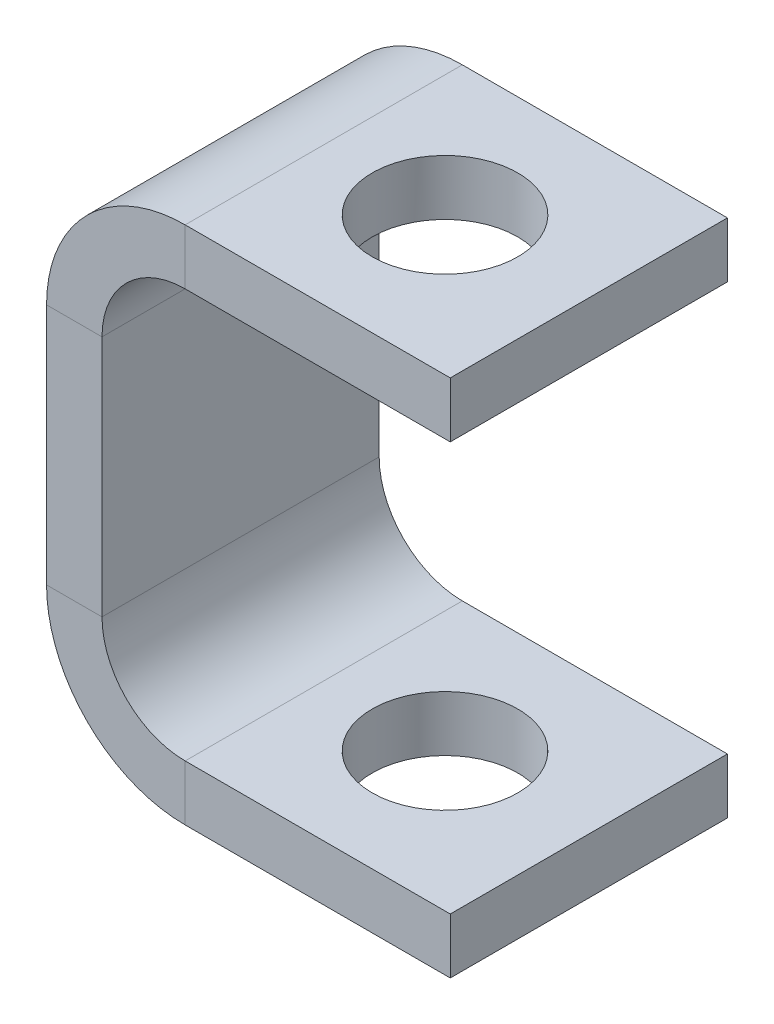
ISO-10303-21;
HEADER;
FILE_DESCRIPTION(('STEP AP214'),'2;1');
FILE_NAME('part.step','',(''),(''),'','','');
FILE_SCHEMA(('AUTOMOTIVE_DESIGN { 1 0 10303 214 1 1 1 1 }'));
ENDSEC;
DATA;
#1=APPLICATION_CONTEXT('core data for automotive mechanical design processes');
#2=APPLICATION_PROTOCOL_DEFINITION('international standard','automotive_design',2000,#1);
#3=PRODUCT_CONTEXT('',#1,'mechanical');
#4=PRODUCT('Part','Part','',(#3));
#5=PRODUCT_RELATED_PRODUCT_CATEGORY('part','',(#4));
#6=PRODUCT_DEFINITION_FORMATION('','',#4);
#7=PRODUCT_DEFINITION_CONTEXT('part definition',#1,'design');
#8=PRODUCT_DEFINITION('design','',#6,#7);
#9=PRODUCT_DEFINITION_SHAPE('','',#8);
#10=(LENGTH_UNIT() NAMED_UNIT(*) SI_UNIT(.MILLI.,.METRE.));
#11=(NAMED_UNIT(*) PLANE_ANGLE_UNIT() SI_UNIT($,.RADIAN.));
#12=(NAMED_UNIT(*) SI_UNIT($,.STERADIAN.) SOLID_ANGLE_UNIT());
#13=UNCERTAINTY_MEASURE_WITH_UNIT(LENGTH_MEASURE(1.E-05),#10,'distance_accuracy_value','');
#14=(GEOMETRIC_REPRESENTATION_CONTEXT(3) GLOBAL_UNCERTAINTY_ASSIGNED_CONTEXT((#13)) GLOBAL_UNIT_ASSIGNED_CONTEXT((#10,
#11,#12)) REPRESENTATION_CONTEXT('',''));
#15=CARTESIAN_POINT('',(0.,0.,0.));
#16=DIRECTION('',(0.,0.,1.));
#17=DIRECTION('',(1.,0.,0.));
#18=AXIS2_PLACEMENT_3D('',#15,#16,#17);
#19=CARTESIAN_POINT('',(-409.941170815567,-35.,-40.));
#20=DIRECTION('',(0.,0.,-1.));
#21=DIRECTION('',(-1.,0.,0.));
#22=AXIS2_PLACEMENT_3D('',#19,#20,#21);
#23=PLANE('',#22);
#24=DIRECTION('',(1.,0.,0.));
#25=VECTOR('',#24,1.);
#26=CARTESIAN_POINT('',(-425.941170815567,-59.,-40.));
#27=LINE('',#26,#25);
#28=CARTESIAN_POINT('',(-385.941170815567,-59.,-40.));
#29=VERTEX_POINT('',#28);
#30=CARTESIAN_POINT('',(-309.425273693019,-59.,-40.));
#31=VERTEX_POINT('',#30);
#32=EDGE_CURVE('E147',#29,#31,#27,.T.);
#33=ORIENTED_EDGE('',*,*,#32,.T.);
#34=DIRECTION('',(0.,1.,0.));
#35=VECTOR('',#34,1.);
#36=CARTESIAN_POINT('',(-309.425273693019,-59.,-40.));
#37=LINE('',#36,#35);
#38=CARTESIAN_POINT('',(-309.425273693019,-75.,-40.));
#39=VERTEX_POINT('',#38);
#40=EDGE_CURVE('E134',#31,#39,#37,.F.);
#41=ORIENTED_EDGE('',*,*,#40,.T.);
#42=DIRECTION('',(1.,0.,0.));
#43=VECTOR('',#42,1.);
#44=CARTESIAN_POINT('',(-425.941170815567,-75.,-40.));
#45=LINE('',#44,#43);
#46=CARTESIAN_POINT('',(-385.941170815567,-75.,-40.));
#47=VERTEX_POINT('',#46);
#48=EDGE_CURVE('E144',#47,#39,#45,.T.);
#49=ORIENTED_EDGE('',*,*,#48,.F.);
#50=DIRECTION('',(0.,1.,0.));
#51=VECTOR('',#50,1.);
#52=CARTESIAN_POINT('',(-385.941170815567,-75.,-40.));
#53=LINE('',#52,#51);
#54=EDGE_CURVE('E233',#47,#29,#53,.T.);
#55=ORIENTED_EDGE('',*,*,#54,.T.);
#56=EDGE_LOOP('',(#33,#41,#49,#55));
#57=FACE_BOUND('',#56,.T.);
#58=ADVANCED_FACE('F44',(#57),#23,.T.);
#59=CARTESIAN_POINT('',(-425.941170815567,-75.,40.));
#60=DIRECTION('',(0.,1.,0.));
#61=DIRECTION('',(0.,0.,1.));
#62=AXIS2_PLACEMENT_3D('',#59,#60,#61);
#63=PLANE('',#62);
#64=CARTESIAN_POINT('',(-350.941170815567,-75.0000000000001,0.));
#65=DIRECTION('',(0.,1.,0.));
#66=DIRECTION('',(0.,0.,1.));
#67=AXIS2_PLACEMENT_3D('',#64,#65,#66);
#68=CIRCLE('',#67,21.);
#69=CARTESIAN_POINT('',(-350.941170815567,-75.0000000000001,21.));
#70=VERTEX_POINT('',#69);
#71=EDGE_CURVE('E303',#70,#70,#68,.T.);
#72=ORIENTED_EDGE('',*,*,#71,.T.);
#73=EDGE_LOOP('',(#72));
#74=FACE_BOUND('',#73,.T.);
#75=DIRECTION('',(0.,0.,1.));
#76=VECTOR('',#75,1.);
#77=CARTESIAN_POINT('',(-309.425273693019,-75.,40.));
#78=LINE('',#77,#76);
#79=CARTESIAN_POINT('',(-309.425273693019,-75.,40.));
#80=VERTEX_POINT('',#79);
#81=EDGE_CURVE('E131',#80,#39,#78,.F.);
#82=ORIENTED_EDGE('',*,*,#81,.F.);
#83=DIRECTION('',(1.,0.,0.));
#84=VECTOR('',#83,1.);
#85=CARTESIAN_POINT('',(-425.941170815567,-75.,40.));
#86=LINE('',#85,#84);
#87=CARTESIAN_POINT('',(-385.941170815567,-75.,40.));
#88=VERTEX_POINT('',#87);
#89=EDGE_CURVE('E182',#88,#80,#86,.T.);
#90=ORIENTED_EDGE('',*,*,#89,.F.);
#91=DIRECTION('',(0.,0.,-1.));
#92=VECTOR('',#91,1.);
#93=CARTESIAN_POINT('',(-385.941170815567,-75.,40.));
#94=LINE('',#93,#92);
#95=EDGE_CURVE('E152',#88,#47,#94,.T.);
#96=ORIENTED_EDGE('',*,*,#95,.T.);
#97=ORIENTED_EDGE('',*,*,#48,.T.);
#98=EDGE_LOOP('',(#82,#90,#96,#97));
#99=FACE_BOUND('',#98,.T.);
#100=ADVANCED_FACE('F150',(#74,#99),#63,.F.);
#101=CARTESIAN_POINT('',(-425.941170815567,-59.,40.));
#102=DIRECTION('',(0.,1.,0.));
#103=DIRECTION('',(0.,0.,1.));
#104=AXIS2_PLACEMENT_3D('',#101,#102,#103);
#105=PLANE('',#104);
#106=CARTESIAN_POINT('',(-350.941170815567,-59.,0.));
#107=DIRECTION('',(0.,1.,0.));
#108=DIRECTION('',(0.,0.,1.));
#109=AXIS2_PLACEMENT_3D('',#106,#107,#108);
#110=CIRCLE('',#109,21.);
#111=CARTESIAN_POINT('',(-350.941170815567,-59.,21.));
#112=VERTEX_POINT('',#111);
#113=EDGE_CURVE('E307',#112,#112,#110,.T.);
#114=ORIENTED_EDGE('',*,*,#113,.F.);
#115=EDGE_LOOP('',(#114));
#116=FACE_BOUND('',#115,.T.);
#117=DIRECTION('',(1.,0.,0.));
#118=VECTOR('',#117,1.);
#119=CARTESIAN_POINT('',(-425.941170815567,-59.,40.));
#120=LINE('',#119,#118);
#121=CARTESIAN_POINT('',(-385.941170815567,-59.,40.));
#122=VERTEX_POINT('',#121);
#123=CARTESIAN_POINT('',(-309.425273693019,-59.,40.));
#124=VERTEX_POINT('',#123);
#125=EDGE_CURVE('E184',#122,#124,#120,.T.);
#126=ORIENTED_EDGE('',*,*,#125,.T.);
#127=DIRECTION('',(0.,0.,-1.));
#128=VECTOR('',#127,1.);
#129=CARTESIAN_POINT('',(-309.425273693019,-59.,300.10815058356));
#130=LINE('',#129,#128);
#131=EDGE_CURVE('E59',#124,#31,#130,.T.);
#132=ORIENTED_EDGE('',*,*,#131,.T.);
#133=ORIENTED_EDGE('',*,*,#32,.F.);
#134=DIRECTION('',(0.,0.,-1.));
#135=VECTOR('',#134,1.);
#136=CARTESIAN_POINT('',(-385.941170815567,-59.,40.));
#137=LINE('',#136,#135);
#138=EDGE_CURVE('E228',#122,#29,#137,.T.);
#139=ORIENTED_EDGE('',*,*,#138,.F.);
#140=EDGE_LOOP('',(#126,#132,#133,#139));
#141=FACE_BOUND('',#140,.T.);
#142=ADVANCED_FACE('F334',(#116,#141),#105,.T.);
#143=CARTESIAN_POINT('',(-385.941170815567,-35.,40.));
#144=DIRECTION('',(0.,0.,1.));
#145=DIRECTION('',(1.,0.,0.));
#146=AXIS2_PLACEMENT_3D('',#143,#144,#145);
#147=PLANE('',#146);
#148=ORIENTED_EDGE('',*,*,#89,.T.);
#149=DIRECTION('',(0.,1.,0.));
#150=VECTOR('',#149,1.);
#151=CARTESIAN_POINT('',(-309.425273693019,-59.,40.));
#152=LINE('',#151,#150);
#153=EDGE_CURVE('E135',#124,#80,#152,.F.);
#154=ORIENTED_EDGE('',*,*,#153,.F.);
#155=ORIENTED_EDGE('',*,*,#125,.F.);
#156=DIRECTION('',(0.,-1.,0.));
#157=VECTOR('',#156,1.);
#158=CARTESIAN_POINT('',(-385.941170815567,-59.,40.));
#159=LINE('',#158,#157);
#160=EDGE_CURVE('E235',#122,#88,#159,.T.);
#161=ORIENTED_EDGE('',*,*,#160,.T.);
#162=EDGE_LOOP('',(#148,#154,#155,#161));
#163=FACE_BOUND('',#162,.T.);
#164=ADVANCED_FACE('F351',(#163),#147,.T.);
#165=CARTESIAN_POINT('',(-409.941170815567,35.,40.));
#166=DIRECTION('',(0.,0.,1.));
#167=DIRECTION('',(1.,0.,0.));
#168=AXIS2_PLACEMENT_3D('',#165,#166,#167);
#169=PLANE('',#168);
#170=DIRECTION('',(1.,0.,0.));
#171=VECTOR('',#170,1.);
#172=CARTESIAN_POINT('',(-305.941170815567,59.,40.));
#173=LINE('',#172,#171);
#174=CARTESIAN_POINT('',(-309.425273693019,59.,40.));
#175=VERTEX_POINT('',#174);
#176=CARTESIAN_POINT('',(-385.941170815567,59.,40.));
#177=VERTEX_POINT('',#176);
#178=EDGE_CURVE('E196',#175,#177,#173,.F.);
#179=ORIENTED_EDGE('',*,*,#178,.F.);
#180=DIRECTION('',(0.,-1.,0.));
#181=VECTOR('',#180,1.);
#182=CARTESIAN_POINT('',(-309.425273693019,59.,40.));
#183=LINE('',#182,#181);
#184=CARTESIAN_POINT('',(-309.425273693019,75.,40.));
#185=VERTEX_POINT('',#184);
#186=EDGE_CURVE('E153',#175,#185,#183,.F.);
#187=ORIENTED_EDGE('',*,*,#186,.T.);
#188=DIRECTION('',(-1.,0.,0.));
#189=VECTOR('',#188,1.);
#190=CARTESIAN_POINT('',(-305.941170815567,75.,40.));
#191=LINE('',#190,#189);
#192=CARTESIAN_POINT('',(-385.941170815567,75.,40.));
#193=VERTEX_POINT('',#192);
#194=EDGE_CURVE('E198',#185,#193,#191,.T.);
#195=ORIENTED_EDGE('',*,*,#194,.T.);
#196=DIRECTION('',(0.,-1.,0.));
#197=VECTOR('',#196,1.);
#198=CARTESIAN_POINT('',(-385.941170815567,75.,40.));
#199=LINE('',#198,#197);
#200=EDGE_CURVE('E13',#193,#177,#199,.T.);
#201=ORIENTED_EDGE('',*,*,#200,.T.);
#202=EDGE_LOOP('',(#179,#187,#195,#201));
#203=FACE_BOUND('',#202,.T.);
#204=ADVANCED_FACE('F292',(#203),#169,.T.);
#205=CARTESIAN_POINT('',(-305.941170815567,59.,40.));
#206=DIRECTION('',(0.,-1.,0.));
#207=DIRECTION('',(0.,0.,-1.));
#208=AXIS2_PLACEMENT_3D('',#205,#206,#207);
#209=PLANE('',#208);
#210=CARTESIAN_POINT('',(-350.941170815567,58.9999999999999,0.));
#211=DIRECTION('',(0.,-1.,0.));
#212=DIRECTION('',(0.,0.,-1.));
#213=AXIS2_PLACEMENT_3D('',#210,#211,#212);
#214=CIRCLE('',#213,21.);
#215=CARTESIAN_POINT('',(-350.941170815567,58.9999999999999,-21.));
#216=VERTEX_POINT('',#215);
#217=EDGE_CURVE('E310',#216,#216,#214,.T.);
#218=ORIENTED_EDGE('',*,*,#217,.F.);
#219=EDGE_LOOP('',(#218));
#220=FACE_BOUND('',#219,.T.);
#221=DIRECTION('',(1.,0.,0.));
#222=VECTOR('',#221,1.);
#223=CARTESIAN_POINT('',(-305.941170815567,59.,-40.));
#224=LINE('',#223,#222);
#225=CARTESIAN_POINT('',(-309.425273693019,59.,-40.));
#226=VERTEX_POINT('',#225);
#227=CARTESIAN_POINT('',(-385.941170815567,59.,-40.));
#228=VERTEX_POINT('',#227);
#229=EDGE_CURVE('E170',#226,#228,#224,.F.);
#230=ORIENTED_EDGE('',*,*,#229,.F.);
#231=DIRECTION('',(0.,0.,-1.));
#232=VECTOR('',#231,1.);
#233=CARTESIAN_POINT('',(-309.425273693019,59.,300.10815058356));
#234=LINE('',#233,#232);
#235=EDGE_CURVE('E67',#226,#175,#234,.F.);
#236=ORIENTED_EDGE('',*,*,#235,.T.);
#237=ORIENTED_EDGE('',*,*,#178,.T.);
#238=DIRECTION('',(0.,0.,-1.));
#239=VECTOR('',#238,1.);
#240=CARTESIAN_POINT('',(-385.941170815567,59.,40.));
#241=LINE('',#240,#239);
#242=EDGE_CURVE('E219',#177,#228,#241,.T.);
#243=ORIENTED_EDGE('',*,*,#242,.T.);
#244=EDGE_LOOP('',(#230,#236,#237,#243));
#245=FACE_BOUND('',#244,.T.);
#246=ADVANCED_FACE('F289',(#220,#245),#209,.T.);
#247=CARTESIAN_POINT('',(-305.941170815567,75.,40.));
#248=DIRECTION('',(0.,-1.,0.));
#249=DIRECTION('',(0.,0.,-1.));
#250=AXIS2_PLACEMENT_3D('',#247,#248,#249);
#251=PLANE('',#250);
#252=CARTESIAN_POINT('',(-350.941170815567,75.,0.));
#253=DIRECTION('',(0.,1.,0.));
#254=DIRECTION('',(0.,0.,1.));
#255=AXIS2_PLACEMENT_3D('',#252,#253,#254);
#256=CIRCLE('',#255,21.);
#257=CARTESIAN_POINT('',(-350.941170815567,75.,21.));
#258=VERTEX_POINT('',#257);
#259=EDGE_CURVE('E313',#258,#258,#256,.T.);
#260=ORIENTED_EDGE('',*,*,#259,.F.);
#261=EDGE_LOOP('',(#260));
#262=FACE_BOUND('',#261,.T.);
#263=DIRECTION('',(0.,0.,-1.));
#264=VECTOR('',#263,1.);
#265=CARTESIAN_POINT('',(-309.425273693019,75.,40.));
#266=LINE('',#265,#264);
#267=CARTESIAN_POINT('',(-309.425273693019,75.,-40.));
#268=VERTEX_POINT('',#267);
#269=EDGE_CURVE('E297',#268,#185,#266,.F.);
#270=ORIENTED_EDGE('',*,*,#269,.F.);
#271=DIRECTION('',(-1.,0.,0.));
#272=VECTOR('',#271,1.);
#273=CARTESIAN_POINT('',(-305.941170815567,75.,-40.));
#274=LINE('',#273,#272);
#275=CARTESIAN_POINT('',(-385.941170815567,75.,-40.));
#276=VERTEX_POINT('',#275);
#277=EDGE_CURVE('E172',#268,#276,#274,.T.);
#278=ORIENTED_EDGE('',*,*,#277,.T.);
#279=DIRECTION('',(0.,0.,-1.));
#280=VECTOR('',#279,1.);
#281=CARTESIAN_POINT('',(-385.941170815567,75.,40.));
#282=LINE('',#281,#280);
#283=EDGE_CURVE('E216',#193,#276,#282,.T.);
#284=ORIENTED_EDGE('',*,*,#283,.F.);
#285=ORIENTED_EDGE('',*,*,#194,.F.);
#286=EDGE_LOOP('',(#270,#278,#284,#285));
#287=FACE_BOUND('',#286,.T.);
#288=ADVANCED_FACE('F296',(#262,#287),#251,.F.);
#289=CARTESIAN_POINT('',(-385.941170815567,-35.,-40.));
#290=DIRECTION('',(0.,0.,1.));
#291=DIRECTION('',(1.,0.,0.));
#292=AXIS2_PLACEMENT_3D('',#289,#290,#291);
#293=PLANE('',#292);
#294=DIRECTION('',(0.,-1.,0.));
#295=VECTOR('',#294,1.);
#296=CARTESIAN_POINT('',(-309.425273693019,59.,-40.));
#297=LINE('',#296,#295);
#298=EDGE_CURVE('E158',#226,#268,#297,.F.);
#299=ORIENTED_EDGE('',*,*,#298,.F.);
#300=ORIENTED_EDGE('',*,*,#229,.T.);
#301=DIRECTION('',(0.,1.,0.));
#302=VECTOR('',#301,1.);
#303=CARTESIAN_POINT('',(-385.941170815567,59.,-40.));
#304=LINE('',#303,#302);
#305=EDGE_CURVE('E239',#228,#276,#304,.T.);
#306=ORIENTED_EDGE('',*,*,#305,.T.);
#307=ORIENTED_EDGE('',*,*,#277,.F.);
#308=EDGE_LOOP('',(#299,#300,#306,#307));
#309=FACE_BOUND('',#308,.T.);
#310=ADVANCED_FACE('F298',(#309),#293,.F.);
#311=CARTESIAN_POINT('',(-385.941170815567,75.,40.));
#312=DIRECTION('',(0.,0.,1.));
#313=DIRECTION('',(1.,0.,0.));
#314=AXIS2_PLACEMENT_3D('',#311,#312,#313);
#315=PLANE('',#314);
#316=ORIENTED_EDGE('',*,*,#200,.F.);
#317=CARTESIAN_POINT('',(-385.941170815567,35.,40.));
#318=DIRECTION('',(0.,0.,-1.));
#319=DIRECTION('',(-1.,0.,0.));
#320=AXIS2_PLACEMENT_3D('',#317,#318,#319);
#321=CIRCLE('',#320,40.);
#322=CARTESIAN_POINT('',(-425.941170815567,35.,40.));
#323=VERTEX_POINT('',#322);
#324=EDGE_CURVE('E200',#193,#323,#321,.F.);
#325=ORIENTED_EDGE('',*,*,#324,.T.);
#326=DIRECTION('',(-1.,0.,0.));
#327=VECTOR('',#326,1.);
#328=CARTESIAN_POINT('',(-409.941170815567,35.,40.));
#329=LINE('',#328,#327);
#330=CARTESIAN_POINT('',(-409.941170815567,35.,40.));
#331=VERTEX_POINT('',#330);
#332=EDGE_CURVE('E52',#331,#323,#329,.T.);
#333=ORIENTED_EDGE('',*,*,#332,.F.);
#334=CARTESIAN_POINT('',(-385.941170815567,35.,40.));
#335=DIRECTION('',(0.,0.,1.));
#336=DIRECTION('',(1.,0.,0.));
#337=AXIS2_PLACEMENT_3D('',#334,#335,#336);
#338=CIRCLE('',#337,24.);
#339=EDGE_CURVE('E193',#177,#331,#338,.T.);
#340=ORIENTED_EDGE('',*,*,#339,.F.);
#341=EDGE_LOOP('',(#316,#325,#333,#340));
#342=FACE_BOUND('',#341,.T.);
#343=ADVANCED_FACE('F46',(#342),#315,.T.);
#344=CARTESIAN_POINT('',(-425.941170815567,35.,-40.));
#345=DIRECTION('',(0.,0.,-1.));
#346=DIRECTION('',(-1.,0.,0.));
#347=AXIS2_PLACEMENT_3D('',#344,#345,#346);
#348=PLANE('',#347);
#349=DIRECTION('',(1.,0.,0.));
#350=VECTOR('',#349,1.);
#351=CARTESIAN_POINT('',(-425.941170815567,35.,-40.));
#352=LINE('',#351,#350);
#353=CARTESIAN_POINT('',(-425.941170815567,35.,-40.));
#354=VERTEX_POINT('',#353);
#355=CARTESIAN_POINT('',(-409.941170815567,35.,-40.));
#356=VERTEX_POINT('',#355);
#357=EDGE_CURVE('E242',#354,#356,#352,.T.);
#358=ORIENTED_EDGE('',*,*,#357,.F.);
#359=CARTESIAN_POINT('',(-385.941170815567,35.,-40.));
#360=DIRECTION('',(0.,0.,-1.));
#361=DIRECTION('',(-1.,0.,0.));
#362=AXIS2_PLACEMENT_3D('',#359,#360,#361);
#363=CIRCLE('',#362,40.);
#364=EDGE_CURVE('E174',#276,#354,#363,.F.);
#365=ORIENTED_EDGE('',*,*,#364,.F.);
#366=ORIENTED_EDGE('',*,*,#305,.F.);
#367=CARTESIAN_POINT('',(-385.941170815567,35.,-40.));
#368=DIRECTION('',(0.,0.,1.));
#369=DIRECTION('',(1.,0.,0.));
#370=AXIS2_PLACEMENT_3D('',#367,#368,#369);
#371=CIRCLE('',#370,24.);
#372=EDGE_CURVE('E167',#228,#356,#371,.T.);
#373=ORIENTED_EDGE('',*,*,#372,.T.);
#374=EDGE_LOOP('',(#358,#365,#366,#373));
#375=FACE_BOUND('',#374,.T.);
#376=ADVANCED_FACE('F284',(#375),#348,.T.);
#377=CARTESIAN_POINT('',(-385.941170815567,59.,-40.));
#378=DIRECTION('',(0.,0.,-1.));
#379=DIRECTION('',(-1.,0.,0.));
#380=AXIS2_PLACEMENT_3D('',#377,#378,#379);
#381=PLANE('',#380);
#382=DIRECTION('',(0.,-1.,0.));
#383=VECTOR('',#382,1.);
#384=CARTESIAN_POINT('',(-425.941170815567,75.,-40.));
#385=LINE('',#384,#383);
#386=CARTESIAN_POINT('',(-425.941170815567,-35.,-40.));
#387=VERTEX_POINT('',#386);
#388=EDGE_CURVE('E177',#354,#387,#385,.T.);
#389=ORIENTED_EDGE('',*,*,#388,.F.);
#390=ORIENTED_EDGE('',*,*,#357,.T.);
#391=DIRECTION('',(0.,1.,0.));
#392=VECTOR('',#391,1.);
#393=CARTESIAN_POINT('',(-409.941170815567,75.,-40.));
#394=LINE('',#393,#392);
#395=CARTESIAN_POINT('',(-409.941170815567,-35.,-40.));
#396=VERTEX_POINT('',#395);
#397=EDGE_CURVE('E164',#356,#396,#394,.F.);
#398=ORIENTED_EDGE('',*,*,#397,.T.);
#399=DIRECTION('',(-1.,0.,0.));
#400=VECTOR('',#399,1.);
#401=CARTESIAN_POINT('',(-409.941170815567,-35.,-40.));
#402=LINE('',#401,#400);
#403=EDGE_CURVE('E231',#396,#387,#402,.T.);
#404=ORIENTED_EDGE('',*,*,#403,.T.);
#405=EDGE_LOOP('',(#389,#390,#398,#404));
#406=FACE_BOUND('',#405,.T.);
#407=ADVANCED_FACE('F277',(#406),#381,.T.);
#408=CARTESIAN_POINT('',(-425.941170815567,-35.,40.));
#409=DIRECTION('',(0.,0.,1.));
#410=DIRECTION('',(1.,0.,0.));
#411=AXIS2_PLACEMENT_3D('',#408,#409,#410);
#412=PLANE('',#411);
#413=DIRECTION('',(1.,0.,0.));
#414=VECTOR('',#413,1.);
#415=CARTESIAN_POINT('',(-425.941170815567,-35.,40.));
#416=LINE('',#415,#414);
#417=CARTESIAN_POINT('',(-425.941170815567,-35.,40.));
#418=VERTEX_POINT('',#417);
#419=CARTESIAN_POINT('',(-409.941170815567,-35.,40.));
#420=VERTEX_POINT('',#419);
#421=EDGE_CURVE('E237',#418,#420,#416,.T.);
#422=ORIENTED_EDGE('',*,*,#421,.F.);
#423=CARTESIAN_POINT('',(-385.941170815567,-35.,40.));
#424=DIRECTION('',(0.,0.,-1.));
#425=DIRECTION('',(-1.,0.,0.));
#426=AXIS2_PLACEMENT_3D('',#423,#424,#425);
#427=CIRCLE('',#426,40.);
#428=EDGE_CURVE('E206',#418,#88,#427,.F.);
#429=ORIENTED_EDGE('',*,*,#428,.T.);
#430=ORIENTED_EDGE('',*,*,#160,.F.);
#431=CARTESIAN_POINT('',(-385.941170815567,-35.,40.));
#432=DIRECTION('',(0.,0.,1.));
#433=DIRECTION('',(1.,0.,0.));
#434=AXIS2_PLACEMENT_3D('',#431,#432,#433);
#435=CIRCLE('',#434,24.);
#436=EDGE_CURVE('E187',#420,#122,#435,.T.);
#437=ORIENTED_EDGE('',*,*,#436,.F.);
#438=EDGE_LOOP('',(#422,#429,#430,#437));
#439=FACE_BOUND('',#438,.T.);
#440=ADVANCED_FACE('F266',(#439),#412,.T.);
#441=CARTESIAN_POINT('',(-385.941170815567,-59.,40.));
#442=DIRECTION('',(0.,0.,1.));
#443=DIRECTION('',(1.,0.,0.));
#444=AXIS2_PLACEMENT_3D('',#441,#442,#443);
#445=PLANE('',#444);
#446=DIRECTION('',(0.,-1.,0.));
#447=VECTOR('',#446,1.);
#448=CARTESIAN_POINT('',(-425.941170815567,75.,40.));
#449=LINE('',#448,#447);
#450=EDGE_CURVE('E203',#323,#418,#449,.T.);
#451=ORIENTED_EDGE('',*,*,#450,.T.);
#452=ORIENTED_EDGE('',*,*,#421,.T.);
#453=DIRECTION('',(0.,1.,0.));
#454=VECTOR('',#453,1.);
#455=CARTESIAN_POINT('',(-409.941170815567,75.,40.));
#456=LINE('',#455,#454);
#457=EDGE_CURVE('E190',#331,#420,#456,.F.);
#458=ORIENTED_EDGE('',*,*,#457,.F.);
#459=ORIENTED_EDGE('',*,*,#332,.T.);
#460=EDGE_LOOP('',(#451,#452,#458,#459));
#461=FACE_BOUND('',#460,.T.);
#462=ADVANCED_FACE('F245',(#461),#445,.T.);
#463=CARTESIAN_POINT('',(-385.941170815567,-75.,-40.));
#464=DIRECTION('',(0.,0.,-1.));
#465=DIRECTION('',(-1.,0.,0.));
#466=AXIS2_PLACEMENT_3D('',#463,#464,#465);
#467=PLANE('',#466);
#468=ORIENTED_EDGE('',*,*,#54,.F.);
#469=CARTESIAN_POINT('',(-385.941170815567,-35.,-40.));
#470=DIRECTION('',(0.,0.,-1.));
#471=DIRECTION('',(-1.,0.,0.));
#472=AXIS2_PLACEMENT_3D('',#469,#470,#471);
#473=CIRCLE('',#472,40.);
#474=EDGE_CURVE('E180',#387,#47,#473,.F.);
#475=ORIENTED_EDGE('',*,*,#474,.F.);
#476=ORIENTED_EDGE('',*,*,#403,.F.);
#477=CARTESIAN_POINT('',(-385.941170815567,-35.,-40.));
#478=DIRECTION('',(0.,0.,1.));
#479=DIRECTION('',(1.,0.,0.));
#480=AXIS2_PLACEMENT_3D('',#477,#478,#479);
#481=CIRCLE('',#480,24.);
#482=EDGE_CURVE('E155',#396,#29,#481,.T.);
#483=ORIENTED_EDGE('',*,*,#482,.T.);
#484=EDGE_LOOP('',(#468,#475,#476,#483));
#485=FACE_BOUND('',#484,.T.);
#486=ADVANCED_FACE('F339',(#485),#467,.T.);
#487=CARTESIAN_POINT('',(-385.941170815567,-35.,40.));
#488=DIRECTION('',(0.,0.,-1.));
#489=DIRECTION('',(-1.,0.,0.));
#490=AXIS2_PLACEMENT_3D('',#487,#488,#489);
#491=CYLINDRICAL_SURFACE('',#490,24.);
#492=ORIENTED_EDGE('',*,*,#138,.T.);
#493=ORIENTED_EDGE('',*,*,#482,.F.);
#494=DIRECTION('',(0.,0.,-1.));
#495=VECTOR('',#494,1.);
#496=CARTESIAN_POINT('',(-409.941170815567,-35.,40.));
#497=LINE('',#496,#495);
#498=EDGE_CURVE('E225',#420,#396,#497,.T.);
#499=ORIENTED_EDGE('',*,*,#498,.F.);
#500=ORIENTED_EDGE('',*,*,#436,.T.);
#501=EDGE_LOOP('',(#492,#493,#499,#500));
#502=FACE_BOUND('',#501,.T.);
#503=ADVANCED_FACE('F272',(#502),#491,.F.);
#504=CARTESIAN_POINT('',(-409.941170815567,75.,40.));
#505=DIRECTION('',(1.,0.,0.));
#506=DIRECTION('',(0.,0.,-1.));
#507=AXIS2_PLACEMENT_3D('',#504,#505,#506);
#508=PLANE('',#507);
#509=ORIENTED_EDGE('',*,*,#498,.T.);
#510=ORIENTED_EDGE('',*,*,#397,.F.);
#511=DIRECTION('',(0.,0.,-1.));
#512=VECTOR('',#511,1.);
#513=CARTESIAN_POINT('',(-409.941170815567,35.,40.));
#514=LINE('',#513,#512);
#515=EDGE_CURVE('E222',#331,#356,#514,.T.);
#516=ORIENTED_EDGE('',*,*,#515,.F.);
#517=ORIENTED_EDGE('',*,*,#457,.T.);
#518=EDGE_LOOP('',(#509,#510,#516,#517));
#519=FACE_BOUND('',#518,.T.);
#520=ADVANCED_FACE('F275',(#519),#508,.T.);
#521=CARTESIAN_POINT('',(-385.941170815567,35.,40.));
#522=DIRECTION('',(0.,0.,-1.));
#523=DIRECTION('',(-1.,0.,0.));
#524=AXIS2_PLACEMENT_3D('',#521,#522,#523);
#525=CYLINDRICAL_SURFACE('',#524,24.);
#526=ORIENTED_EDGE('',*,*,#515,.T.);
#527=ORIENTED_EDGE('',*,*,#372,.F.);
#528=ORIENTED_EDGE('',*,*,#242,.F.);
#529=ORIENTED_EDGE('',*,*,#339,.T.);
#530=EDGE_LOOP('',(#526,#527,#528,#529));
#531=FACE_BOUND('',#530,.T.);
#532=ADVANCED_FACE('F281',(#531),#525,.F.);
#533=CARTESIAN_POINT('',(-385.941170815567,35.,40.));
#534=DIRECTION('',(0.,0.,-1.));
#535=DIRECTION('',(-1.,0.,0.));
#536=AXIS2_PLACEMENT_3D('',#533,#534,#535);
#537=CYLINDRICAL_SURFACE('',#536,40.);
#538=ORIENTED_EDGE('',*,*,#283,.T.);
#539=ORIENTED_EDGE('',*,*,#364,.T.);
#540=DIRECTION('',(0.,0.,-1.));
#541=VECTOR('',#540,1.);
#542=CARTESIAN_POINT('',(-425.941170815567,35.,40.));
#543=LINE('',#542,#541);
#544=EDGE_CURVE('E213',#323,#354,#543,.T.);
#545=ORIENTED_EDGE('',*,*,#544,.F.);
#546=ORIENTED_EDGE('',*,*,#324,.F.);
#547=EDGE_LOOP('',(#538,#539,#545,#546));
#548=FACE_BOUND('',#547,.T.);
#549=ADVANCED_FACE('F256',(#548),#537,.T.);
#550=CARTESIAN_POINT('',(-425.941170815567,75.,40.));
#551=DIRECTION('',(1.,0.,0.));
#552=DIRECTION('',(0.,0.,-1.));
#553=AXIS2_PLACEMENT_3D('',#550,#551,#552);
#554=PLANE('',#553);
#555=ORIENTED_EDGE('',*,*,#544,.T.);
#556=ORIENTED_EDGE('',*,*,#388,.T.);
#557=DIRECTION('',(0.,0.,-1.));
#558=VECTOR('',#557,1.);
#559=CARTESIAN_POINT('',(-425.941170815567,-35.,40.));
#560=LINE('',#559,#558);
#561=EDGE_CURVE('E210',#418,#387,#560,.T.);
#562=ORIENTED_EDGE('',*,*,#561,.F.);
#563=ORIENTED_EDGE('',*,*,#450,.F.);
#564=EDGE_LOOP('',(#555,#556,#562,#563));
#565=FACE_BOUND('',#564,.T.);
#566=ADVANCED_FACE('F260',(#565),#554,.F.);
#567=CARTESIAN_POINT('',(-385.941170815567,-35.,40.));
#568=DIRECTION('',(0.,0.,-1.));
#569=DIRECTION('',(-1.,0.,0.));
#570=AXIS2_PLACEMENT_3D('',#567,#568,#569);
#571=CYLINDRICAL_SURFACE('',#570,40.);
#572=ORIENTED_EDGE('',*,*,#561,.T.);
#573=ORIENTED_EDGE('',*,*,#474,.T.);
#574=ORIENTED_EDGE('',*,*,#95,.F.);
#575=ORIENTED_EDGE('',*,*,#428,.F.);
#576=EDGE_LOOP('',(#572,#573,#574,#575));
#577=FACE_BOUND('',#576,.T.);
#578=ADVANCED_FACE('F264',(#577),#571,.T.);
#579=CARTESIAN_POINT('',(-309.425273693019,59.,300.10815058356));
#580=DIRECTION('',(-1.,0.,0.));
#581=DIRECTION('',(0.,0.,-1.));
#582=AXIS2_PLACEMENT_3D('',#579,#580,#581);
#583=PLANE('',#582);
#584=ORIENTED_EDGE('',*,*,#186,.F.);
#585=ORIENTED_EDGE('',*,*,#235,.F.);
#586=ORIENTED_EDGE('',*,*,#298,.T.);
#587=ORIENTED_EDGE('',*,*,#269,.T.);
#588=EDGE_LOOP('',(#584,#585,#586,#587));
#589=FACE_BOUND('',#588,.T.);
#590=ADVANCED_FACE('F365',(#589),#583,.F.);
#591=CARTESIAN_POINT('',(-309.425273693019,-59.,300.10815058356));
#592=DIRECTION('',(1.,0.,0.));
#593=DIRECTION('',(0.,0.,-1.));
#594=AXIS2_PLACEMENT_3D('',#591,#592,#593);
#595=PLANE('',#594);
#596=ORIENTED_EDGE('',*,*,#40,.F.);
#597=ORIENTED_EDGE('',*,*,#131,.F.);
#598=ORIENTED_EDGE('',*,*,#153,.T.);
#599=ORIENTED_EDGE('',*,*,#81,.T.);
#600=EDGE_LOOP('',(#596,#597,#598,#599));
#601=FACE_BOUND('',#600,.T.);
#602=ADVANCED_FACE('F133',(#601),#595,.T.);
#603=CARTESIAN_POINT('',(-350.941170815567,-525.,0.));
#604=DIRECTION('',(0.,1.,0.));
#605=DIRECTION('',(0.,0.,1.));
#606=AXIS2_PLACEMENT_3D('',#603,#604,#605);
#607=CYLINDRICAL_SURFACE('',#606,21.);
#608=ORIENTED_EDGE('',*,*,#217,.T.);
#609=EDGE_LOOP('',(#608));
#610=FACE_BOUND('',#609,.T.);
#611=ORIENTED_EDGE('',*,*,#259,.T.);
#612=EDGE_LOOP('',(#611));
#613=FACE_BOUND('',#612,.T.);
#614=ADVANCED_FACE('F317',(#610,#613),#607,.F.);
#615=ORIENTED_EDGE('',*,*,#113,.T.);
#616=EDGE_LOOP('',(#615));
#617=FACE_BOUND('',#616,.T.);
#618=ORIENTED_EDGE('',*,*,#71,.F.);
#619=EDGE_LOOP('',(#618));
#620=FACE_BOUND('',#619,.T.);
#621=ADVANCED_FACE('F479',(#617,#620),#607,.F.);
#622=CLOSED_SHELL('',(#58,#100,#142,#164,#204,#246,#288,#310,#343,#376,#407,#440,#462,#486,#503,
#520,#532,#549,#566,#578,#590,#602,#614,#621));
#623=MANIFOLD_SOLID_BREP('B2',#622);
#624=ADVANCED_BREP_SHAPE_REPRESENTATION('',(#18,#623),#14);
#625=SHAPE_DEFINITION_REPRESENTATION(#9,#624);
ENDSEC;
END-ISO-10303-21;
